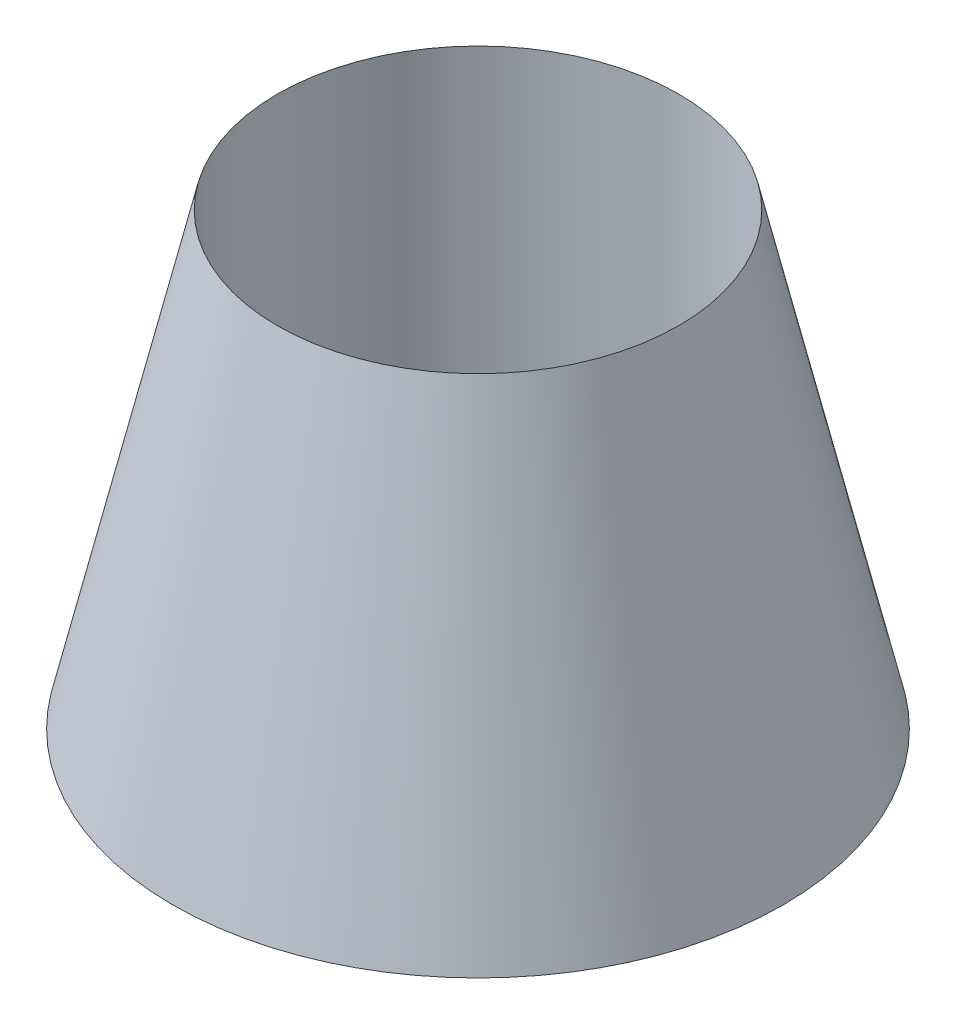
from build123d import *


with BuildPart() as part:
    # Sketch1 → Revolve1 (revolve)
    with BuildSketch(Plane(origin=(0, 0, 0), x_dir=(0, 0, -1), z_dir=(1, 0, 0))):
        Polygon((1.5875, 3.556), (1.5875, 0), (2.413, 0), align=None)
    revolve(axis=Axis((0, 0, 0), (0, 1, 0)))


solid = part.part
